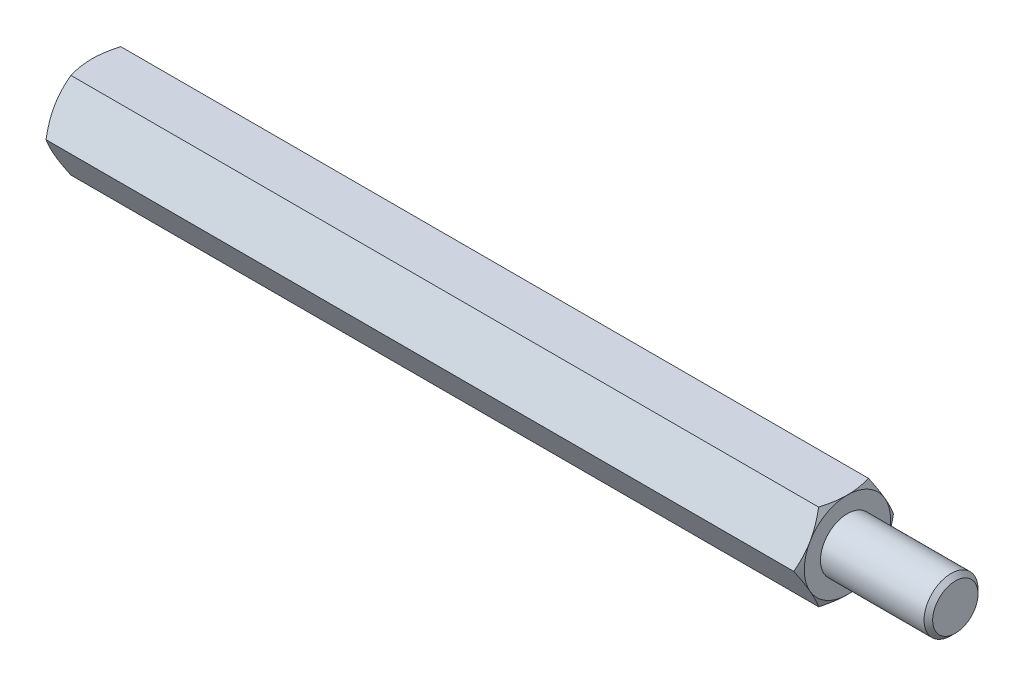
from build123d import *

# Parameters (mm, degrees)
EXTRUDE2_DEPTH = 35
SKETCH3_R      = 2.1
EXTRUDE3_DEPTH = 10
SKETCH5_R      = 2.5
EXTRUDE4_DEPTH = 10
CHAMFER1_SIZE  = 0.4


with BuildPart() as part:
    # Sketch1 → Extrude2 (new, symmetric)
    with BuildSketch(Plane(origin=(0, 0, 0), x_dir=(0, 0, -1), z_dir=(1, 0, 0))):
        Polygon((2.309401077, 4), (-2.309401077, 4), (-4.618802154, 0), (-2.309401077, -4), (2.309401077, -4), (4.618802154, 0), align=None)
    extrude(amount=EXTRUDE2_DEPTH, both=True)

    # Sketch2 → Cut-Revolve1 (revolve, cut)
    with BuildSketch(Plane.XY):
        with BuildLine():
            Line((-35, 4), (-33.5, 6.598076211))
            ThreePointArc((-33.5, 6.598076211), (-33.98810136, 7.776457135), (-35, 7))
            Line((-35, 7), (-35, 4))
        make_face()
    cut_revolve1 = revolve(axis=Axis((0, 0, 0), (1, 0, 0)), mode=Mode.SUBTRACT)

    # Mirror1: Cut-Revolve1 across plane
    add(cut_revolve1.mirror(Plane(origin=(0, 0, 0), x_dir=(0, 0, 1), z_dir=(1, 0, 0))), mode=Mode.SUBTRACT)

    # Sketch3 → Extrude3 (cut)
    with BuildSketch(Plane.ZY.offset(35)):
        Circle(SKETCH3_R)
    extrude(amount=-EXTRUDE3_DEPTH, mode=Mode.SUBTRACT)

    # Sketch4 → Cut-Revolve2 (revolve, cut)
    with BuildSketch(Plane.XY, mode=Mode.PRIVATE) as cut_revolve2_sk:
        Polygon((-25, 0), (-25, 2.1), (-23.787564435, 0), align=None)
    revolve(cut_revolve2_sk.sketch.rotate(Axis((-23.787564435, 0, 0), (-1, 0, 0)), 180), axis=Axis((-23.787564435, 0, 0), (-1, 0, 0)), mode=Mode.SUBTRACT)

    # Sketch5 → Extrude4 (add)
    with BuildSketch(Plane(origin=(35, 0, 0), x_dir=(0, 0, -1), z_dir=(1, 0, 0))):
        Circle(SKETCH5_R)
    extrude(amount=EXTRUDE4_DEPTH)

    # Chamfer1
    chamfer1_edges = [part.edges().sort_by_distance(p)[0] for p in [
        (45, 0, 2.5),
    ]]
    chamfer(chamfer1_edges, length=CHAMFER1_SIZE)


solid = part.part
